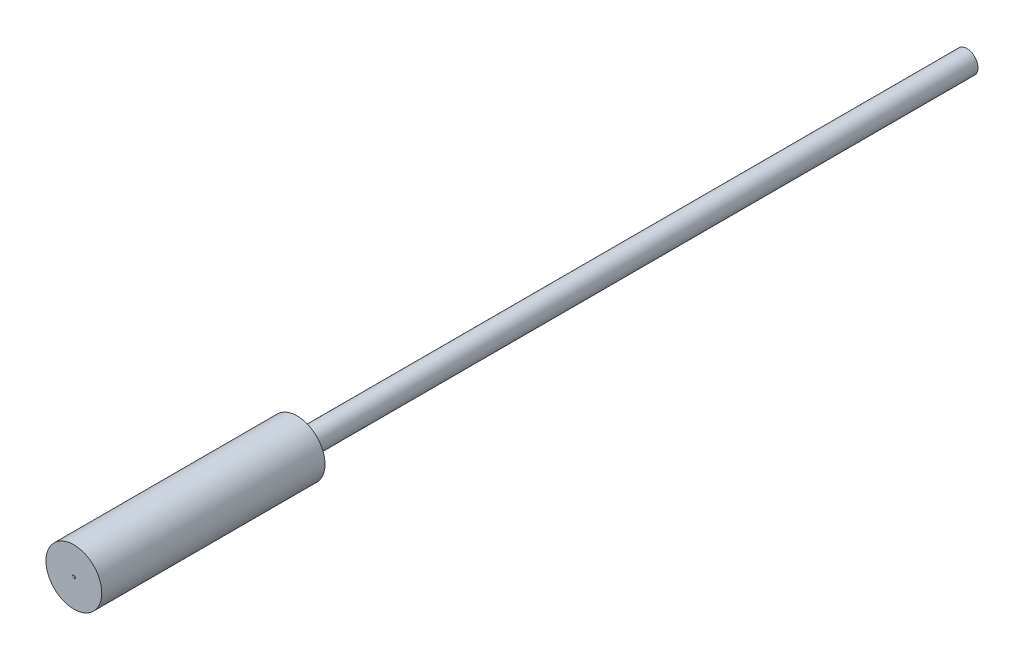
from build123d import *

# Parameters (mm, degrees)
SKETCH_1_R          = 1.25
EXTRUDE_1_DEPTH     = 10
SKETCH_2_R          = 0.5
EXTRUDE_2_DEPTH     = 30
SKETCH_3_R          = 0.0675
SKETCH_3_R_2        = 0.0625
CUT_EXTRUDE_1_DEPTH = 0.1


with BuildPart() as part:
    # Sketch 1 → Extrude 1 (new body)
    with BuildSketch(Plane.XY):
        Circle(SKETCH_1_R)
    extrude(amount=-EXTRUDE_1_DEPTH)

    # Sketch 2 → Extrude 2 (add)
    with BuildSketch(Plane(origin=(0, 0, -10), x_dir=(-1, 0, 0), z_dir=(0, 0, -1))):
        Circle(SKETCH_2_R)
    extrude(amount=EXTRUDE_2_DEPTH)

    # Sketch 3 → Cut-Extrude 1 (cut)
    with BuildSketch(Plane.XY):
        Circle(SKETCH_3_R)
        Circle(SKETCH_3_R_2, mode=Mode.SUBTRACT)
    extrude(amount=-CUT_EXTRUDE_1_DEPTH, mode=Mode.SUBTRACT)


solid = part.part
